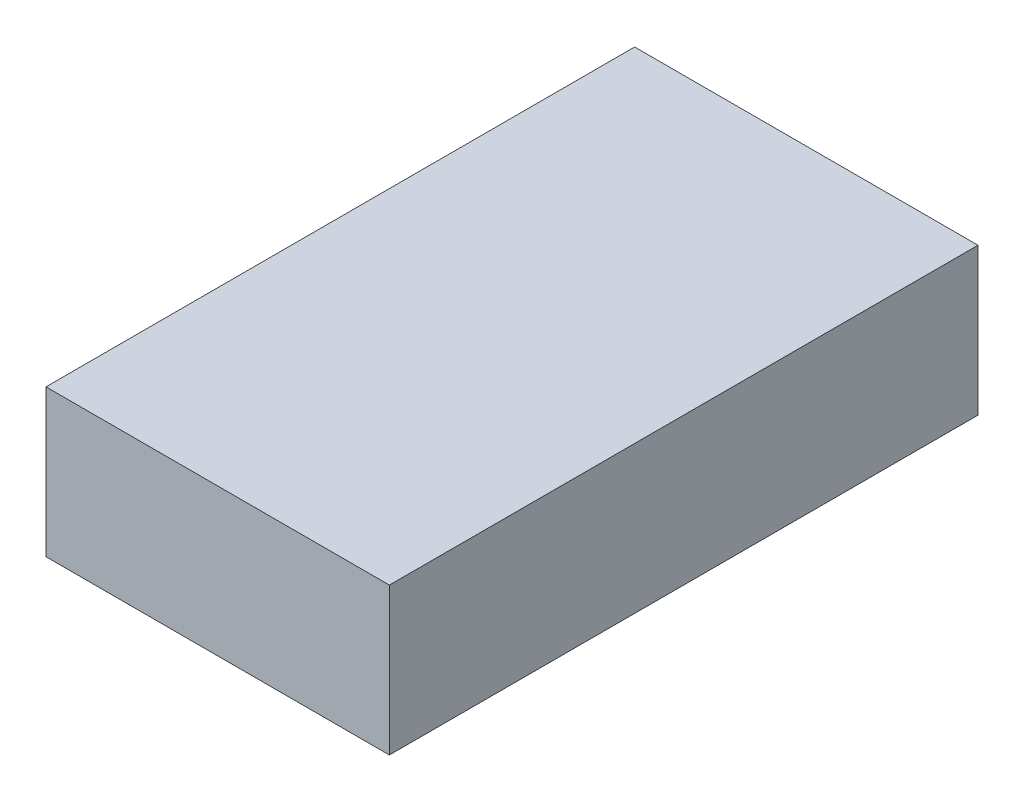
ISO-10303-21;
HEADER;
FILE_DESCRIPTION(('STEP AP214'),'2;1');
FILE_NAME('part.step','',(''),(''),'','','');
FILE_SCHEMA(('AUTOMOTIVE_DESIGN { 1 0 10303 214 1 1 1 1 }'));
ENDSEC;
DATA;
#1=APPLICATION_CONTEXT('core data for automotive mechanical design processes');
#2=APPLICATION_PROTOCOL_DEFINITION('international standard','automotive_design',2000,#1);
#3=PRODUCT_CONTEXT('',#1,'mechanical');
#4=PRODUCT('Part','Part','',(#3));
#5=PRODUCT_RELATED_PRODUCT_CATEGORY('part','',(#4));
#6=PRODUCT_DEFINITION_FORMATION('','',#4);
#7=PRODUCT_DEFINITION_CONTEXT('part definition',#1,'design');
#8=PRODUCT_DEFINITION('design','',#6,#7);
#9=PRODUCT_DEFINITION_SHAPE('','',#8);
#10=(LENGTH_UNIT() NAMED_UNIT(*) SI_UNIT(.MILLI.,.METRE.));
#11=(NAMED_UNIT(*) PLANE_ANGLE_UNIT() SI_UNIT($,.RADIAN.));
#12=(NAMED_UNIT(*) SI_UNIT($,.STERADIAN.) SOLID_ANGLE_UNIT());
#13=UNCERTAINTY_MEASURE_WITH_UNIT(LENGTH_MEASURE(1.E-05),#10,'distance_accuracy_value','');
#14=(GEOMETRIC_REPRESENTATION_CONTEXT(3) GLOBAL_UNCERTAINTY_ASSIGNED_CONTEXT((#13)) GLOBAL_UNIT_ASSIGNED_CONTEXT((#10,
#11,#12)) REPRESENTATION_CONTEXT('',''));
#15=CARTESIAN_POINT('',(0.,0.,0.));
#16=DIRECTION('',(0.,0.,1.));
#17=DIRECTION('',(1.,0.,0.));
#18=AXIS2_PLACEMENT_3D('',#15,#16,#17);
#19=CARTESIAN_POINT('',(0.,3.,0.));
#20=DIRECTION('',(1.,0.,0.));
#21=DIRECTION('',(0.,0.,-1.));
#22=AXIS2_PLACEMENT_3D('',#19,#20,#21);
#23=PLANE('',#22);
#24=DIRECTION('',(0.,0.,1.));
#25=VECTOR('',#24,1.);
#26=CARTESIAN_POINT('',(0.,0.,0.));
#27=LINE('',#26,#25);
#28=CARTESIAN_POINT('',(0.,0.,-12.));
#29=VERTEX_POINT('',#28);
#30=CARTESIAN_POINT('',(0.,0.,0.));
#31=VERTEX_POINT('',#30);
#32=EDGE_CURVE('E95',#29,#31,#27,.T.);
#33=ORIENTED_EDGE('',*,*,#32,.T.);
#34=DIRECTION('',(0.,-1.,0.));
#35=VECTOR('',#34,1.);
#36=CARTESIAN_POINT('',(0.,3.,0.));
#37=LINE('',#36,#35);
#38=CARTESIAN_POINT('',(0.,3.,0.));
#39=VERTEX_POINT('',#38);
#40=EDGE_CURVE('E11',#39,#31,#37,.T.);
#41=ORIENTED_EDGE('',*,*,#40,.F.);
#42=DIRECTION('',(0.,0.,1.));
#43=VECTOR('',#42,1.);
#44=CARTESIAN_POINT('',(0.,3.,0.));
#45=LINE('',#44,#43);
#46=CARTESIAN_POINT('',(0.,3.,-12.));
#47=VERTEX_POINT('',#46);
#48=EDGE_CURVE('E83',#47,#39,#45,.T.);
#49=ORIENTED_EDGE('',*,*,#48,.F.);
#50=DIRECTION('',(0.,-1.,0.));
#51=VECTOR('',#50,1.);
#52=CARTESIAN_POINT('',(0.,3.,-12.));
#53=LINE('',#52,#51);
#54=EDGE_CURVE('E91',#47,#29,#53,.T.);
#55=ORIENTED_EDGE('',*,*,#54,.T.);
#56=EDGE_LOOP('',(#33,#41,#49,#55));
#57=FACE_BOUND('',#56,.T.);
#58=ADVANCED_FACE('F32',(#57),#23,.F.);
#59=CARTESIAN_POINT('',(0.,3.,0.));
#60=DIRECTION('',(0.,0.,-1.));
#61=DIRECTION('',(-1.,0.,0.));
#62=AXIS2_PLACEMENT_3D('',#59,#60,#61);
#63=PLANE('',#62);
#64=DIRECTION('',(1.,0.,0.));
#65=VECTOR('',#64,1.);
#66=CARTESIAN_POINT('',(0.,0.,0.));
#67=LINE('',#66,#65);
#68=CARTESIAN_POINT('',(7.,0.,0.));
#69=VERTEX_POINT('',#68);
#70=EDGE_CURVE('E87',#31,#69,#67,.T.);
#71=ORIENTED_EDGE('',*,*,#70,.T.);
#72=DIRECTION('',(0.,-1.,0.));
#73=VECTOR('',#72,1.);
#74=CARTESIAN_POINT('',(7.,3.,0.));
#75=LINE('',#74,#73);
#76=CARTESIAN_POINT('',(7.,3.,0.));
#77=VERTEX_POINT('',#76);
#78=EDGE_CURVE('E40',#77,#69,#75,.T.);
#79=ORIENTED_EDGE('',*,*,#78,.F.);
#80=DIRECTION('',(1.,0.,0.));
#81=VECTOR('',#80,1.);
#82=CARTESIAN_POINT('',(0.,3.,0.));
#83=LINE('',#82,#81);
#84=EDGE_CURVE('E78',#39,#77,#83,.T.);
#85=ORIENTED_EDGE('',*,*,#84,.F.);
#86=ORIENTED_EDGE('',*,*,#40,.T.);
#87=EDGE_LOOP('',(#71,#79,#85,#86));
#88=FACE_BOUND('',#87,.T.);
#89=ADVANCED_FACE('F86',(#88),#63,.F.);
#90=CARTESIAN_POINT('',(7.,3.,0.));
#91=DIRECTION('',(-1.,0.,0.));
#92=DIRECTION('',(0.,0.,1.));
#93=AXIS2_PLACEMENT_3D('',#90,#91,#92);
#94=PLANE('',#93);
#95=DIRECTION('',(0.,0.,-1.));
#96=VECTOR('',#95,1.);
#97=CARTESIAN_POINT('',(7.,0.,0.));
#98=LINE('',#97,#96);
#99=CARTESIAN_POINT('',(7.,0.,-12.));
#100=VERTEX_POINT('',#99);
#101=EDGE_CURVE('E65',#69,#100,#98,.T.);
#102=ORIENTED_EDGE('',*,*,#101,.T.);
#103=DIRECTION('',(0.,-1.,0.));
#104=VECTOR('',#103,1.);
#105=CARTESIAN_POINT('',(7.,3.,-12.));
#106=LINE('',#105,#104);
#107=CARTESIAN_POINT('',(7.,3.,-12.));
#108=VERTEX_POINT('',#107);
#109=EDGE_CURVE('E88',#108,#100,#106,.T.);
#110=ORIENTED_EDGE('',*,*,#109,.F.);
#111=DIRECTION('',(0.,0.,-1.));
#112=VECTOR('',#111,1.);
#113=CARTESIAN_POINT('',(7.,3.,0.));
#114=LINE('',#113,#112);
#115=EDGE_CURVE('E81',#77,#108,#114,.T.);
#116=ORIENTED_EDGE('',*,*,#115,.F.);
#117=ORIENTED_EDGE('',*,*,#78,.T.);
#118=EDGE_LOOP('',(#102,#110,#116,#117));
#119=FACE_BOUND('',#118,.T.);
#120=ADVANCED_FACE('F89',(#119),#94,.F.);
#121=CARTESIAN_POINT('',(0.,3.,-12.));
#122=DIRECTION('',(0.,0.,1.));
#123=DIRECTION('',(1.,0.,0.));
#124=AXIS2_PLACEMENT_3D('',#121,#122,#123);
#125=PLANE('',#124);
#126=DIRECTION('',(-1.,0.,0.));
#127=VECTOR('',#126,1.);
#128=CARTESIAN_POINT('',(0.,0.,-12.));
#129=LINE('',#128,#127);
#130=EDGE_CURVE('E71',#100,#29,#129,.T.);
#131=ORIENTED_EDGE('',*,*,#130,.T.);
#132=ORIENTED_EDGE('',*,*,#54,.F.);
#133=DIRECTION('',(-1.,0.,0.));
#134=VECTOR('',#133,1.);
#135=CARTESIAN_POINT('',(0.,3.,-12.));
#136=LINE('',#135,#134);
#137=EDGE_CURVE('E48',#108,#47,#136,.T.);
#138=ORIENTED_EDGE('',*,*,#137,.F.);
#139=ORIENTED_EDGE('',*,*,#109,.T.);
#140=EDGE_LOOP('',(#131,#132,#138,#139));
#141=FACE_BOUND('',#140,.T.);
#142=ADVANCED_FACE('F102',(#141),#125,.F.);
#143=CARTESIAN_POINT('',(0.,3.,0.));
#144=DIRECTION('',(0.,-1.,0.));
#145=DIRECTION('',(0.,0.,-1.));
#146=AXIS2_PLACEMENT_3D('',#143,#144,#145);
#147=PLANE('',#146);
#148=ORIENTED_EDGE('',*,*,#48,.T.);
#149=ORIENTED_EDGE('',*,*,#84,.T.);
#150=ORIENTED_EDGE('',*,*,#115,.T.);
#151=ORIENTED_EDGE('',*,*,#137,.T.);
#152=EDGE_LOOP('',(#148,#149,#150,#151));
#153=FACE_BOUND('',#152,.T.);
#154=ADVANCED_FACE('F79',(#153),#147,.F.);
#155=CARTESIAN_POINT('',(0.,0.,0.));
#156=DIRECTION('',(0.,-1.,0.));
#157=DIRECTION('',(0.,0.,-1.));
#158=AXIS2_PLACEMENT_3D('',#155,#156,#157);
#159=PLANE('',#158);
#160=ORIENTED_EDGE('',*,*,#32,.F.);
#161=ORIENTED_EDGE('',*,*,#130,.F.);
#162=ORIENTED_EDGE('',*,*,#101,.F.);
#163=ORIENTED_EDGE('',*,*,#70,.F.);
#164=EDGE_LOOP('',(#160,#161,#162,#163));
#165=FACE_BOUND('',#164,.T.);
#166=ADVANCED_FACE('F105',(#165),#159,.T.);
#167=CLOSED_SHELL('',(#58,#89,#120,#142,#154,#166));
#168=MANIFOLD_SOLID_BREP('B2',#167);
#169=ADVANCED_BREP_SHAPE_REPRESENTATION('',(#18,#168),#14);
#170=SHAPE_DEFINITION_REPRESENTATION(#9,#169);
ENDSEC;
END-ISO-10303-21;
